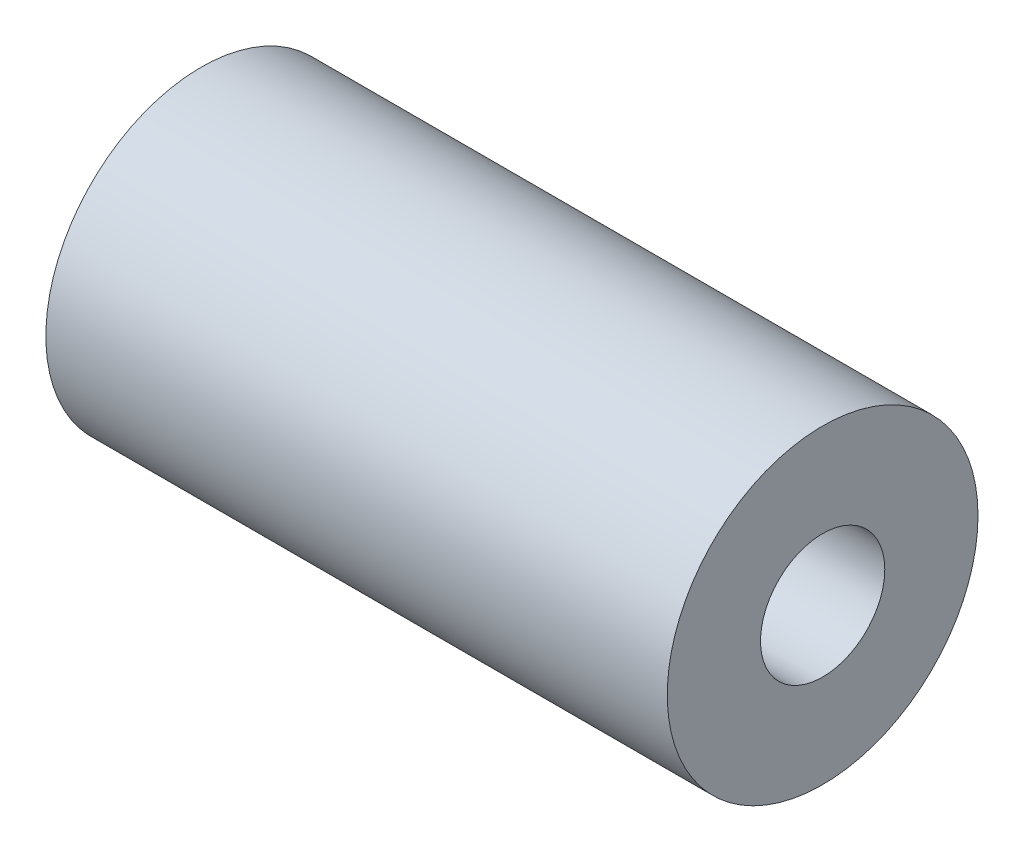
ISO-10303-21;
HEADER;
FILE_DESCRIPTION(('STEP AP214'),'2;1');
FILE_NAME('part.step','',(''),(''),'','','');
FILE_SCHEMA(('AUTOMOTIVE_DESIGN { 1 0 10303 214 1 1 1 1 }'));
ENDSEC;
DATA;
#1=APPLICATION_CONTEXT('core data for automotive mechanical design processes');
#2=APPLICATION_PROTOCOL_DEFINITION('international standard','automotive_design',2000,#1);
#3=PRODUCT_CONTEXT('',#1,'mechanical');
#4=PRODUCT('Part','Part','',(#3));
#5=PRODUCT_RELATED_PRODUCT_CATEGORY('part','',(#4));
#6=PRODUCT_DEFINITION_FORMATION('','',#4);
#7=PRODUCT_DEFINITION_CONTEXT('part definition',#1,'design');
#8=PRODUCT_DEFINITION('design','',#6,#7);
#9=PRODUCT_DEFINITION_SHAPE('','',#8);
#10=(LENGTH_UNIT() NAMED_UNIT(*) SI_UNIT(.MILLI.,.METRE.));
#11=(NAMED_UNIT(*) PLANE_ANGLE_UNIT() SI_UNIT($,.RADIAN.));
#12=(NAMED_UNIT(*) SI_UNIT($,.STERADIAN.) SOLID_ANGLE_UNIT());
#13=UNCERTAINTY_MEASURE_WITH_UNIT(LENGTH_MEASURE(1.E-05),#10,'distance_accuracy_value','');
#14=(GEOMETRIC_REPRESENTATION_CONTEXT(3) GLOBAL_UNCERTAINTY_ASSIGNED_CONTEXT((#13)) GLOBAL_UNIT_ASSIGNED_CONTEXT((#10,
#11,#12)) REPRESENTATION_CONTEXT('',''));
#15=CARTESIAN_POINT('',(0.,0.,0.));
#16=DIRECTION('',(0.,0.,1.));
#17=DIRECTION('',(1.,0.,0.));
#18=AXIS2_PLACEMENT_3D('',#15,#16,#17);
#19=CARTESIAN_POINT('',(50.,0.,0.));
#20=DIRECTION('',(1.,0.,0.));
#21=DIRECTION('',(0.,0.,-1.));
#22=AXIS2_PLACEMENT_3D('',#19,#20,#21);
#23=PLANE('',#22);
#24=CARTESIAN_POINT('',(50.,0.,0.));
#25=DIRECTION('',(1.,0.,0.));
#26=DIRECTION('',(0.,0.,-1.));
#27=AXIS2_PLACEMENT_3D('',#24,#25,#26);
#28=CIRCLE('',#27,12.5);
#29=CARTESIAN_POINT('',(50.,0.,-12.5));
#30=VERTEX_POINT('',#29);
#31=EDGE_CURVE('E10',#30,#30,#28,.T.);
#32=ORIENTED_EDGE('',*,*,#31,.T.);
#33=EDGE_LOOP('',(#32));
#34=FACE_BOUND('',#33,.T.);
#35=CARTESIAN_POINT('',(50.,0.,0.));
#36=DIRECTION('',(1.,0.,0.));
#37=DIRECTION('',(0.,0.,-1.));
#38=AXIS2_PLACEMENT_3D('',#35,#36,#37);
#39=CIRCLE('',#38,5.);
#40=CARTESIAN_POINT('',(50.,0.,-5.));
#41=VERTEX_POINT('',#40);
#42=EDGE_CURVE('E43',#41,#41,#39,.T.);
#43=ORIENTED_EDGE('',*,*,#42,.F.);
#44=EDGE_LOOP('',(#43));
#45=FACE_BOUND('',#44,.T.);
#46=ADVANCED_FACE('F32',(#34,#45),#23,.T.);
#47=CARTESIAN_POINT('',(0.,0.,0.));
#48=DIRECTION('',(1.,0.,0.));
#49=DIRECTION('',(0.,0.,-1.));
#50=AXIS2_PLACEMENT_3D('',#47,#48,#49);
#51=PLANE('',#50);
#52=CARTESIAN_POINT('',(0.,0.,0.));
#53=DIRECTION('',(1.,0.,0.));
#54=DIRECTION('',(0.,0.,-1.));
#55=AXIS2_PLACEMENT_3D('',#52,#53,#54);
#56=CIRCLE('',#55,12.5);
#57=CARTESIAN_POINT('',(0.,0.,-12.5));
#58=VERTEX_POINT('',#57);
#59=EDGE_CURVE('E36',#58,#58,#56,.T.);
#60=ORIENTED_EDGE('',*,*,#59,.F.);
#61=EDGE_LOOP('',(#60));
#62=FACE_BOUND('',#61,.T.);
#63=CARTESIAN_POINT('',(0.,0.,0.));
#64=DIRECTION('',(1.,0.,0.));
#65=DIRECTION('',(0.,0.,-1.));
#66=AXIS2_PLACEMENT_3D('',#63,#64,#65);
#67=CIRCLE('',#66,5.);
#68=CARTESIAN_POINT('',(0.,0.,-5.));
#69=VERTEX_POINT('',#68);
#70=EDGE_CURVE('E45',#69,#69,#67,.T.);
#71=ORIENTED_EDGE('',*,*,#70,.T.);
#72=EDGE_LOOP('',(#71));
#73=FACE_BOUND('',#72,.T.);
#74=ADVANCED_FACE('F55',(#62,#73),#51,.F.);
#75=CARTESIAN_POINT('',(50.,0.,0.));
#76=DIRECTION('',(-1.,0.,0.));
#77=DIRECTION('',(0.,0.,1.));
#78=AXIS2_PLACEMENT_3D('',#75,#76,#77);
#79=CYLINDRICAL_SURFACE('',#78,12.5);
#80=ORIENTED_EDGE('',*,*,#31,.F.);
#81=EDGE_LOOP('',(#80));
#82=FACE_BOUND('',#81,.T.);
#83=ORIENTED_EDGE('',*,*,#59,.T.);
#84=EDGE_LOOP('',(#83));
#85=FACE_BOUND('',#84,.T.);
#86=ADVANCED_FACE('F34',(#82,#85),#79,.T.);
#87=CARTESIAN_POINT('',(50.,0.,0.));
#88=DIRECTION('',(-1.,0.,0.));
#89=DIRECTION('',(0.,0.,1.));
#90=AXIS2_PLACEMENT_3D('',#87,#88,#89);
#91=CYLINDRICAL_SURFACE('',#90,5.);
#92=ORIENTED_EDGE('',*,*,#42,.T.);
#93=EDGE_LOOP('',(#92));
#94=FACE_BOUND('',#93,.T.);
#95=ORIENTED_EDGE('',*,*,#70,.F.);
#96=EDGE_LOOP('',(#95));
#97=FACE_BOUND('',#96,.T.);
#98=ADVANCED_FACE('F51',(#94,#97),#91,.F.);
#99=CLOSED_SHELL('',(#46,#74,#86,#98));
#100=MANIFOLD_SOLID_BREP('B2',#99);
#101=ADVANCED_BREP_SHAPE_REPRESENTATION('',(#18,#100),#14);
#102=SHAPE_DEFINITION_REPRESENTATION(#9,#101);
ENDSEC;
END-ISO-10303-21;
